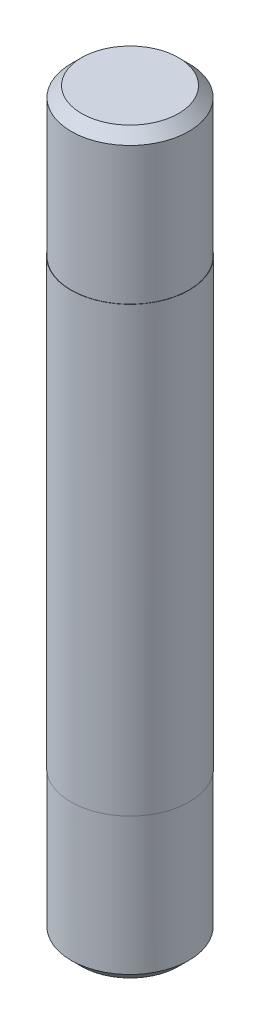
from build123d import *

# Parameters (mm, degrees)
SKETCH1_R          = 2
EXTRUDE1_DEPTH     = 25
CUT_EXTRUDE1_START = -5
SKETCH2_R          = 2
SKETCH2_R_2        = 1.99
CUT_EXTRUDE1_DEPTH = 5
SKETCH3_R          = 2
SKETCH3_R_2        = 1.99
CUT_EXTRUDE2_DEPTH = 5
CHAMFER1_SIZE      = 0.35


with BuildPart() as part:
    # Sketch1 → Extrude1 (new body)
    with BuildSketch(Plane(origin=(0, 0, 0), x_dir=(1, 0, 0), z_dir=(0, 1, 0))):
        with Locations(Location((0, 0, 0), (0, 0, 270))):
            Circle(SKETCH1_R)
    extrude(amount=EXTRUDE1_DEPTH)

    # Sketch2 → Cut-Extrude1 (cut)
    with BuildSketch(Plane(origin=(0, 25, 0), x_dir=(-1, 0, 0), z_dir=(0, 1, 0)).offset(CUT_EXTRUDE1_START)):
        with Locations(Location((0, 0, 0), (0, 0, 90))):
            Circle(SKETCH2_R)
        with Locations(Location((0, 0, 0), (0, 0, 90))):
            Circle(SKETCH2_R_2, mode=Mode.SUBTRACT)
    extrude(amount=CUT_EXTRUDE1_DEPTH, mode=Mode.SUBTRACT)

    # Sketch3 → Cut-Extrude2 (cut)
    with BuildSketch(Plane.XZ):
        with Locations(Location((0, 0, 0), (0, 0, 270))):
            Circle(SKETCH3_R)
        with Locations(Location((0, 0, 0), (0, 0, 90))):
            Circle(SKETCH3_R_2, mode=Mode.SUBTRACT)
    extrude(amount=-CUT_EXTRUDE2_DEPTH, mode=Mode.SUBTRACT)

    # Chamfer1
    chamfer1_edges = [part.edges().sort_by_distance(p)[0] for p in [
        (0, 0, -1.99),
        (0, 25, -1.99),
    ]]
    chamfer(chamfer1_edges, length=CHAMFER1_SIZE)


solid = part.part
